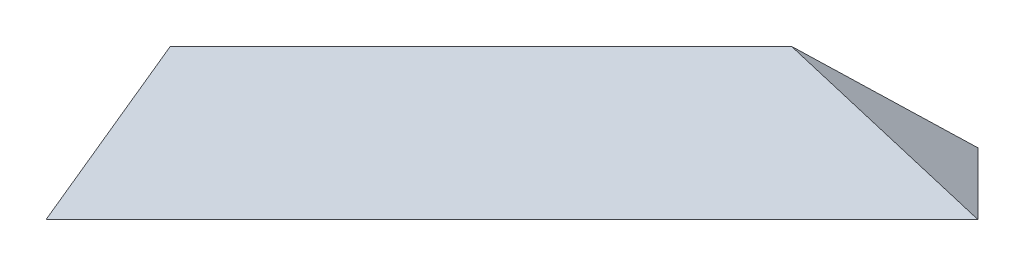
ISO-10303-21;
HEADER;
FILE_DESCRIPTION(('STEP AP214'),'2;1');
FILE_NAME('part.step','',(''),(''),'','','');
FILE_SCHEMA(('AUTOMOTIVE_DESIGN { 1 0 10303 214 1 1 1 1 }'));
ENDSEC;
DATA;
#1=APPLICATION_CONTEXT('core data for automotive mechanical design processes');
#2=APPLICATION_PROTOCOL_DEFINITION('international standard','automotive_design',2000,#1);
#3=PRODUCT_CONTEXT('',#1,'mechanical');
#4=PRODUCT('Part','Part','',(#3));
#5=PRODUCT_RELATED_PRODUCT_CATEGORY('part','',(#4));
#6=PRODUCT_DEFINITION_FORMATION('','',#4);
#7=PRODUCT_DEFINITION_CONTEXT('part definition',#1,'design');
#8=PRODUCT_DEFINITION('design','',#6,#7);
#9=PRODUCT_DEFINITION_SHAPE('','',#8);
#10=(LENGTH_UNIT() NAMED_UNIT(*) SI_UNIT(.MILLI.,.METRE.));
#11=(NAMED_UNIT(*) PLANE_ANGLE_UNIT() SI_UNIT($,.RADIAN.));
#12=(NAMED_UNIT(*) SI_UNIT($,.STERADIAN.) SOLID_ANGLE_UNIT());
#13=UNCERTAINTY_MEASURE_WITH_UNIT(LENGTH_MEASURE(1.E-05),#10,'distance_accuracy_value','');
#14=(GEOMETRIC_REPRESENTATION_CONTEXT(3) GLOBAL_UNCERTAINTY_ASSIGNED_CONTEXT((#13)) GLOBAL_UNIT_ASSIGNED_CONTEXT((#10,
#11,#12)) REPRESENTATION_CONTEXT('',''));
#15=CARTESIAN_POINT('',(0.,0.,0.));
#16=DIRECTION('',(0.,0.,1.));
#17=DIRECTION('',(1.,0.,0.));
#18=AXIS2_PLACEMENT_3D('',#15,#16,#17);
#19=CARTESIAN_POINT('',(-356.173432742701,26.8362503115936,81.1823241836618));
#20=DIRECTION('',(0.707106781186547,0.,0.707106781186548));
#21=DIRECTION('',(0.707106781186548,0.,-0.707106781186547));
#22=AXIS2_PLACEMENT_3D('',#19,#20,#21);
#23=PLANE('',#22);
#24=DIRECTION('',(0.707106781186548,0.,-0.707106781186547));
#25=VECTOR('',#24,1.);
#26=CARTESIAN_POINT('',(-334.960229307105,9.83625031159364,59.9691207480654));
#27=LINE('',#26,#25);
#28=CARTESIAN_POINT('',(-348.742855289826,9.83625031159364,73.7517467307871));
#29=VERTEX_POINT('',#28);
#30=CARTESIAN_POINT('',(-338.142209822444,9.83625031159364,63.1511012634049));
#31=VERTEX_POINT('',#30);
#32=EDGE_CURVE('E48',#29,#31,#27,.T.);
#33=ORIENTED_EDGE('',*,*,#32,.T.);
#34=DIRECTION('',(-0.588348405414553,0.554700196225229,0.588348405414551));
#35=VECTOR('',#34,1.);
#36=CARTESIAN_POINT('',(-356.173432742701,26.8362503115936,81.1823241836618));
#37=LINE('',#36,#35);
#38=CARTESIAN_POINT('',(-334.960229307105,6.83625031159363,59.9691207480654));
#39=VERTEX_POINT('',#38);
#40=EDGE_CURVE('E33',#39,#31,#37,.T.);
#41=ORIENTED_EDGE('',*,*,#40,.F.);
#42=DIRECTION('',(0.707106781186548,0.,-0.707106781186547));
#43=VECTOR('',#42,1.);
#44=CARTESIAN_POINT('',(-334.960229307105,6.83625031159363,59.9691207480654));
#45=LINE('',#44,#43);
#46=CARTESIAN_POINT('',(-348.742855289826,6.83625031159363,73.751746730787));
#47=VERTEX_POINT('',#46);
#48=EDGE_CURVE('E65',#47,#39,#45,.T.);
#49=ORIENTED_EDGE('',*,*,#48,.F.);
#50=DIRECTION('',(0.,1.,0.));
#51=VECTOR('',#50,1.);
#52=CARTESIAN_POINT('',(-348.742855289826,26.8362503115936,73.751746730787));
#53=LINE('',#52,#51);
#54=EDGE_CURVE('E58',#47,#29,#53,.T.);
#55=ORIENTED_EDGE('',*,*,#54,.T.);
#56=EDGE_LOOP('',(#33,#41,#49,#55));
#57=FACE_BOUND('',#56,.T.);
#58=ADVANCED_FACE('F30',(#57),#23,.F.);
#59=CARTESIAN_POINT('',(-334.960229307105,6.83625031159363,59.9691207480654));
#60=DIRECTION('',(-0.392232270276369,-0.832050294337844,0.392232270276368));
#61=DIRECTION('',(0.904534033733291,-0.426401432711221,0.));
#62=AXIS2_PLACEMENT_3D('',#59,#60,#61);
#63=PLANE('',#62);
#64=ORIENTED_EDGE('',*,*,#40,.T.);
#65=DIRECTION('',(-0.857492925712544,0.485071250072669,0.171498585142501));
#66=VECTOR('',#65,1.);
#67=CARTESIAN_POINT('',(-332.838908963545,6.83625031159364,62.0904410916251));
#68=LINE('',#67,#66);
#69=CARTESIAN_POINT('',(-332.838908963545,6.83625031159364,62.0904410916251));
#70=VERTEX_POINT('',#69);
#71=EDGE_CURVE('E79',#70,#31,#68,.T.);
#72=ORIENTED_EDGE('',*,*,#71,.F.);
#73=DIRECTION('',(-0.707106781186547,0.,-0.707106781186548));
#74=VECTOR('',#73,1.);
#75=CARTESIAN_POINT('',(-334.960229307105,6.83625031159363,59.9691207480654));
#76=LINE('',#75,#74);
#77=EDGE_CURVE('E70',#70,#39,#76,.T.);
#78=ORIENTED_EDGE('',*,*,#77,.T.);
#79=EDGE_LOOP('',(#64,#72,#78));
#80=FACE_BOUND('',#79,.T.);
#81=ADVANCED_FACE('F78',(#80),#63,.F.);
#82=CARTESIAN_POINT('',(-367.383695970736,6.83625031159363,72.3131498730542));
#83=DIRECTION('',(0.,1.,0.));
#84=DIRECTION('',(-0.766044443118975,0.,0.642787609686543));
#85=AXIS2_PLACEMENT_3D('',#82,#83,#84);
#86=PLANE('',#85);
#87=DIRECTION('',(-0.707106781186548,0.,0.707106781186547));
#88=VECTOR('',#87,1.);
#89=CARTESIAN_POINT('',(-346.621534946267,6.83625031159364,75.8730670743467));
#90=LINE('',#89,#88);
#91=CARTESIAN_POINT('',(-348.742855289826,6.83625031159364,77.9943874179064));
#92=VERTEX_POINT('',#91);
#93=EDGE_CURVE('E39',#70,#92,#90,.T.);
#94=ORIENTED_EDGE('',*,*,#93,.T.);
#95=DIRECTION('',(0.,0.,1.));
#96=VECTOR('',#95,1.);
#97=CARTESIAN_POINT('',(-348.742855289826,6.83625031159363,99.899691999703));
#98=LINE('',#97,#96);
#99=EDGE_CURVE('E72',#47,#92,#98,.T.);
#100=ORIENTED_EDGE('',*,*,#99,.F.);
#101=ORIENTED_EDGE('',*,*,#48,.T.);
#102=ORIENTED_EDGE('',*,*,#77,.F.);
#103=EDGE_LOOP('',(#94,#100,#101,#102));
#104=FACE_BOUND('',#103,.T.);
#105=ADVANCED_FACE('F68',(#104),#86,.F.);
#106=CARTESIAN_POINT('',(-348.742855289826,6.83625031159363,73.751746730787));
#107=DIRECTION('',(1.,0.,0.));
#108=DIRECTION('',(0.,0.,-1.));
#109=AXIS2_PLACEMENT_3D('',#106,#107,#108);
#110=PLANE('',#109);
#111=ORIENTED_EDGE('',*,*,#54,.F.);
#112=ORIENTED_EDGE('',*,*,#99,.T.);
#113=DIRECTION('',(0.,0.577350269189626,-0.816496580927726));
#114=VECTOR('',#113,1.);
#115=CARTESIAN_POINT('',(-348.742855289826,6.83625031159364,77.9943874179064));
#116=LINE('',#115,#114);
#117=EDGE_CURVE('E11',#92,#29,#116,.T.);
#118=ORIENTED_EDGE('',*,*,#117,.T.);
#119=EDGE_LOOP('',(#111,#112,#118));
#120=FACE_BOUND('',#119,.T.);
#121=ADVANCED_FACE('F86',(#120),#110,.F.);
#122=CARTESIAN_POINT('',(-348.742855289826,9.83625031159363,73.7517467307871));
#123=DIRECTION('',(0.499999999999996,0.707106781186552,0.499999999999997));
#124=DIRECTION('',(0.,-0.577350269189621,0.816496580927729));
#125=AXIS2_PLACEMENT_3D('',#122,#123,#124);
#126=PLANE('',#125);
#127=ORIENTED_EDGE('',*,*,#32,.F.);
#128=ORIENTED_EDGE('',*,*,#117,.F.);
#129=ORIENTED_EDGE('',*,*,#93,.F.);
#130=ORIENTED_EDGE('',*,*,#71,.T.);
#131=EDGE_LOOP('',(#127,#128,#129,#130));
#132=FACE_BOUND('',#131,.T.);
#133=ADVANCED_FACE('F85',(#132),#126,.T.);
#134=CLOSED_SHELL('',(#58,#81,#105,#121,#133));
#135=MANIFOLD_SOLID_BREP('B2',#134);
#136=ADVANCED_BREP_SHAPE_REPRESENTATION('',(#18,#135),#14);
#137=SHAPE_DEFINITION_REPRESENTATION(#9,#136);
ENDSEC;
END-ISO-10303-21;
